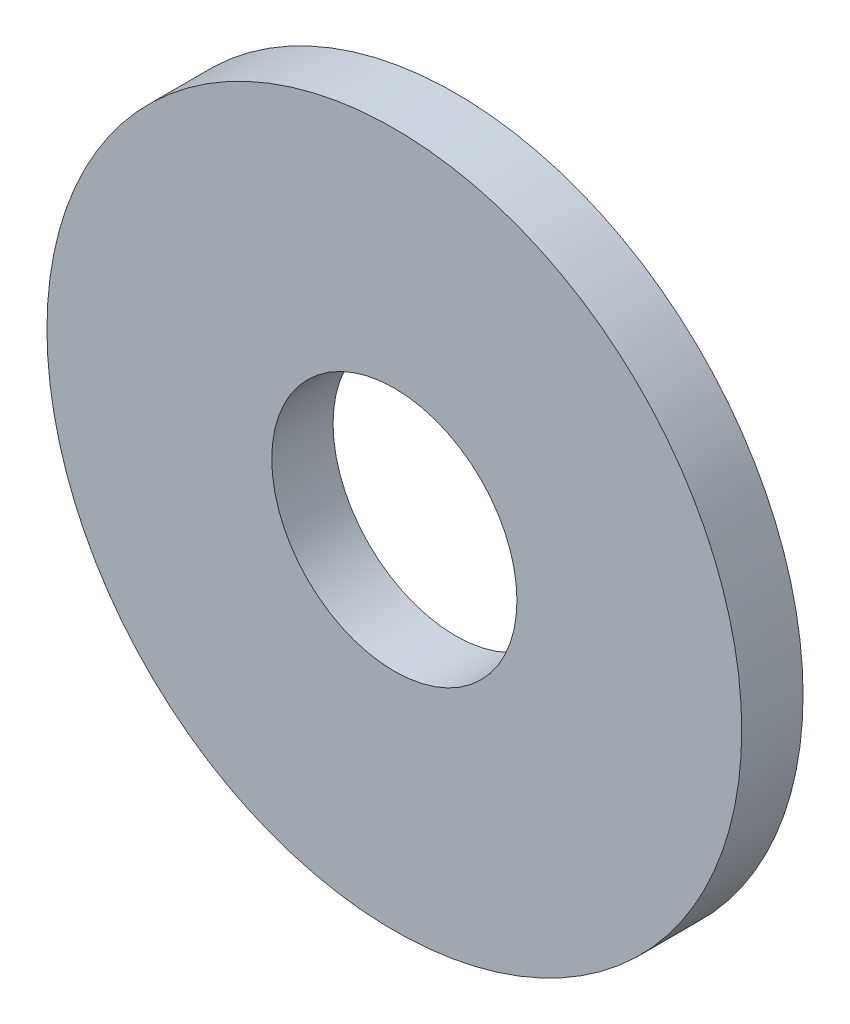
ISO-10303-21;
HEADER;
FILE_DESCRIPTION(('STEP AP214'),'2;1');
FILE_NAME('part.step','',(''),(''),'','','');
FILE_SCHEMA(('AUTOMOTIVE_DESIGN { 1 0 10303 214 1 1 1 1 }'));
ENDSEC;
DATA;
#1=APPLICATION_CONTEXT('core data for automotive mechanical design processes');
#2=APPLICATION_PROTOCOL_DEFINITION('international standard','automotive_design',2000,#1);
#3=PRODUCT_CONTEXT('',#1,'mechanical');
#4=PRODUCT('Part','Part','',(#3));
#5=PRODUCT_RELATED_PRODUCT_CATEGORY('part','',(#4));
#6=PRODUCT_DEFINITION_FORMATION('','',#4);
#7=PRODUCT_DEFINITION_CONTEXT('part definition',#1,'design');
#8=PRODUCT_DEFINITION('design','',#6,#7);
#9=PRODUCT_DEFINITION_SHAPE('','',#8);
#10=(LENGTH_UNIT() NAMED_UNIT(*) SI_UNIT(.MILLI.,.METRE.));
#11=(NAMED_UNIT(*) PLANE_ANGLE_UNIT() SI_UNIT($,.RADIAN.));
#12=(NAMED_UNIT(*) SI_UNIT($,.STERADIAN.) SOLID_ANGLE_UNIT());
#13=UNCERTAINTY_MEASURE_WITH_UNIT(LENGTH_MEASURE(1.E-05),#10,'distance_accuracy_value','');
#14=(GEOMETRIC_REPRESENTATION_CONTEXT(3) GLOBAL_UNCERTAINTY_ASSIGNED_CONTEXT((#13)) GLOBAL_UNIT_ASSIGNED_CONTEXT((#10,
#11,#12)) REPRESENTATION_CONTEXT('',''));
#15=CARTESIAN_POINT('',(0.,0.,0.));
#16=DIRECTION('',(0.,0.,1.));
#17=DIRECTION('',(1.,0.,0.));
#18=AXIS2_PLACEMENT_3D('',#15,#16,#17);
#19=CARTESIAN_POINT('',(0.,0.,1.5));
#20=DIRECTION('',(0.,0.,1.));
#21=DIRECTION('',(1.,0.,0.));
#22=AXIS2_PLACEMENT_3D('',#19,#20,#21);
#23=PLANE('',#22);
#24=CARTESIAN_POINT('',(0.,0.,1.5));
#25=DIRECTION('',(0.,0.,1.));
#26=DIRECTION('',(1.,0.,0.));
#27=AXIS2_PLACEMENT_3D('',#24,#25,#26);
#28=CIRCLE('',#27,8.5);
#29=CARTESIAN_POINT('',(8.5,0.,1.5));
#30=VERTEX_POINT('',#29);
#31=EDGE_CURVE('E10',#30,#30,#28,.T.);
#32=ORIENTED_EDGE('',*,*,#31,.T.);
#33=EDGE_LOOP('',(#32));
#34=FACE_BOUND('',#33,.T.);
#35=CARTESIAN_POINT('',(0.,0.,1.5));
#36=DIRECTION('',(0.,0.,1.));
#37=DIRECTION('',(1.,0.,0.));
#38=AXIS2_PLACEMENT_3D('',#35,#36,#37);
#39=CIRCLE('',#38,3.);
#40=CARTESIAN_POINT('',(3.,0.,1.5));
#41=VERTEX_POINT('',#40);
#42=EDGE_CURVE('E39',#41,#41,#39,.T.);
#43=ORIENTED_EDGE('',*,*,#42,.F.);
#44=EDGE_LOOP('',(#43));
#45=FACE_BOUND('',#44,.T.);
#46=ADVANCED_FACE('F28',(#34,#45),#23,.T.);
#47=CARTESIAN_POINT('',(0.,0.,0.));
#48=DIRECTION('',(0.,0.,1.));
#49=DIRECTION('',(1.,0.,0.));
#50=AXIS2_PLACEMENT_3D('',#47,#48,#49);
#51=PLANE('',#50);
#52=CARTESIAN_POINT('',(0.,0.,0.));
#53=DIRECTION('',(0.,0.,1.));
#54=DIRECTION('',(1.,0.,0.));
#55=AXIS2_PLACEMENT_3D('',#52,#53,#54);
#56=CIRCLE('',#55,8.5);
#57=CARTESIAN_POINT('',(8.5,0.,0.));
#58=VERTEX_POINT('',#57);
#59=EDGE_CURVE('E35',#58,#58,#56,.T.);
#60=ORIENTED_EDGE('',*,*,#59,.F.);
#61=EDGE_LOOP('',(#60));
#62=FACE_BOUND('',#61,.T.);
#63=CARTESIAN_POINT('',(0.,0.,0.));
#64=DIRECTION('',(0.,0.,1.));
#65=DIRECTION('',(1.,0.,0.));
#66=AXIS2_PLACEMENT_3D('',#63,#64,#65);
#67=CIRCLE('',#66,3.);
#68=CARTESIAN_POINT('',(3.,0.,0.));
#69=VERTEX_POINT('',#68);
#70=EDGE_CURVE('E43',#69,#69,#67,.T.);
#71=ORIENTED_EDGE('',*,*,#70,.T.);
#72=EDGE_LOOP('',(#71));
#73=FACE_BOUND('',#72,.T.);
#74=ADVANCED_FACE('F49',(#62,#73),#51,.F.);
#75=CARTESIAN_POINT('',(0.,0.,1.5));
#76=DIRECTION('',(0.,0.,-1.));
#77=DIRECTION('',(-1.,0.,0.));
#78=AXIS2_PLACEMENT_3D('',#75,#76,#77);
#79=CYLINDRICAL_SURFACE('',#78,8.5);
#80=ORIENTED_EDGE('',*,*,#31,.F.);
#81=EDGE_LOOP('',(#80));
#82=FACE_BOUND('',#81,.T.);
#83=ORIENTED_EDGE('',*,*,#59,.T.);
#84=EDGE_LOOP('',(#83));
#85=FACE_BOUND('',#84,.T.);
#86=ADVANCED_FACE('F30',(#82,#85),#79,.T.);
#87=CARTESIAN_POINT('',(0.,0.,1.5));
#88=DIRECTION('',(0.,0.,-1.));
#89=DIRECTION('',(-1.,0.,0.));
#90=AXIS2_PLACEMENT_3D('',#87,#88,#89);
#91=CYLINDRICAL_SURFACE('',#90,3.);
#92=ORIENTED_EDGE('',*,*,#42,.T.);
#93=EDGE_LOOP('',(#92));
#94=FACE_BOUND('',#93,.T.);
#95=ORIENTED_EDGE('',*,*,#70,.F.);
#96=EDGE_LOOP('',(#95));
#97=FACE_BOUND('',#96,.T.);
#98=ADVANCED_FACE('F51',(#94,#97),#91,.F.);
#99=CLOSED_SHELL('',(#46,#74,#86,#98));
#100=MANIFOLD_SOLID_BREP('B2',#99);
#101=ADVANCED_BREP_SHAPE_REPRESENTATION('',(#18,#100),#14);
#102=SHAPE_DEFINITION_REPRESENTATION(#9,#101);
ENDSEC;
END-ISO-10303-21;
